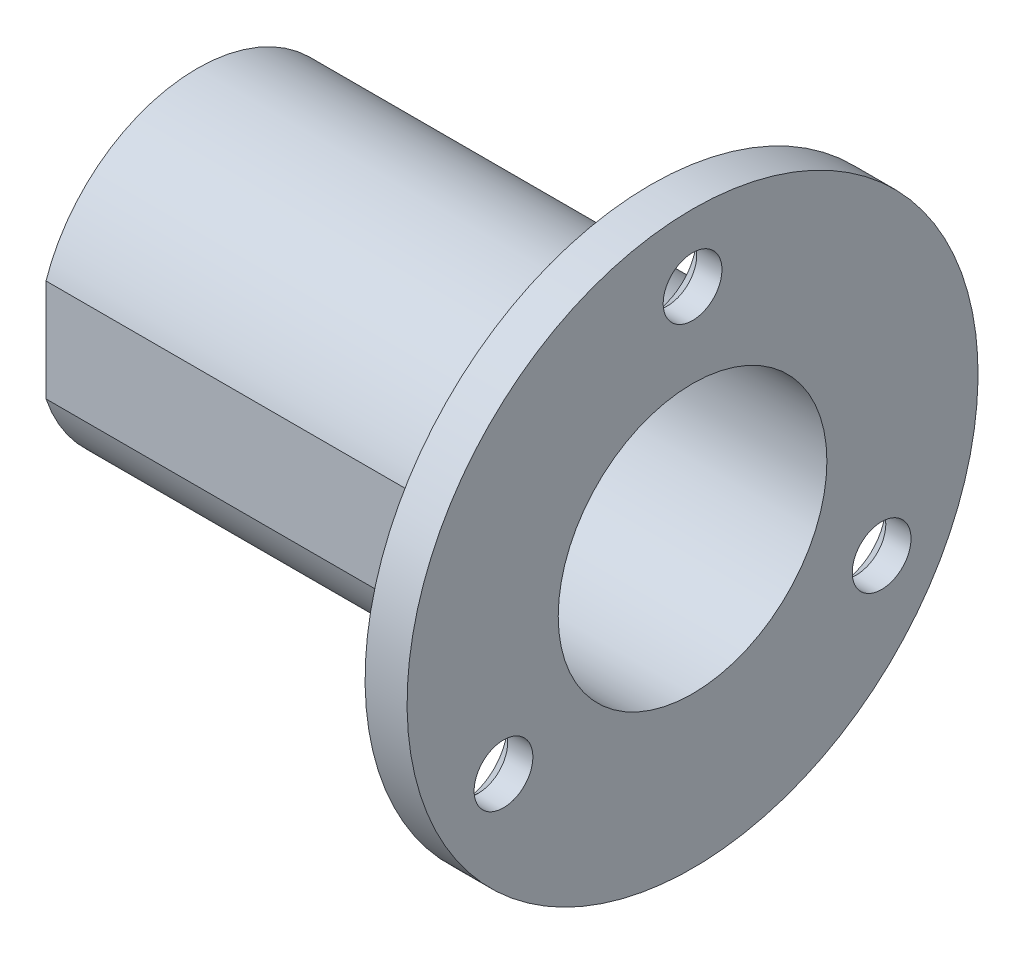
ISO-10303-21;
HEADER;
FILE_DESCRIPTION(('STEP AP214'),'2;1');
FILE_NAME('part.step','',(''),(''),'','','');
FILE_SCHEMA(('AUTOMOTIVE_DESIGN { 1 0 10303 214 1 1 1 1 }'));
ENDSEC;
DATA;
#1=APPLICATION_CONTEXT('core data for automotive mechanical design processes');
#2=APPLICATION_PROTOCOL_DEFINITION('international standard','automotive_design',2000,#1);
#3=PRODUCT_CONTEXT('',#1,'mechanical');
#4=PRODUCT('Part','Part','',(#3));
#5=PRODUCT_RELATED_PRODUCT_CATEGORY('part','',(#4));
#6=PRODUCT_DEFINITION_FORMATION('','',#4);
#7=PRODUCT_DEFINITION_CONTEXT('part definition',#1,'design');
#8=PRODUCT_DEFINITION('design','',#6,#7);
#9=PRODUCT_DEFINITION_SHAPE('','',#8);
#10=(LENGTH_UNIT() NAMED_UNIT(*) SI_UNIT(.MILLI.,.METRE.));
#11=(NAMED_UNIT(*) PLANE_ANGLE_UNIT() SI_UNIT($,.RADIAN.));
#12=(NAMED_UNIT(*) SI_UNIT($,.STERADIAN.) SOLID_ANGLE_UNIT());
#13=UNCERTAINTY_MEASURE_WITH_UNIT(LENGTH_MEASURE(1.E-05),#10,'distance_accuracy_value','');
#14=(GEOMETRIC_REPRESENTATION_CONTEXT(3) GLOBAL_UNCERTAINTY_ASSIGNED_CONTEXT((#13)) GLOBAL_UNIT_ASSIGNED_CONTEXT((#10,
#11,#12)) REPRESENTATION_CONTEXT('',''));
#15=CARTESIAN_POINT('',(0.,0.,0.));
#16=DIRECTION('',(0.,0.,1.));
#17=DIRECTION('',(1.,0.,0.));
#18=AXIS2_PLACEMENT_3D('',#15,#16,#17);
#19=CARTESIAN_POINT('',(11.4164454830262,-22.6498679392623,22.5166604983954));
#20=DIRECTION('',(1.,0.,0.));
#21=DIRECTION('',(0.,0.,-1.));
#22=AXIS2_PLACEMENT_3D('',#19,#20,#21);
#23=CYLINDRICAL_SURFACE('',#22,3.5);
#24=CARTESIAN_POINT('',(11.4164454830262,-22.6498679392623,22.5166604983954));
#25=DIRECTION('',(-1.,0.,0.));
#26=DIRECTION('',(0.,-1.,0.));
#27=AXIS2_PLACEMENT_3D('',#24,#25,#26);
#28=CIRCLE('',#27,3.5);
#29=CARTESIAN_POINT('',(11.4164454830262,-26.1498679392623,22.5166604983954));
#30=VERTEX_POINT('',#29);
#31=EDGE_CURVE('E81',#30,#30,#28,.T.);
#32=ORIENTED_EDGE('',*,*,#31,.T.);
#33=EDGE_LOOP('',(#32));
#34=FACE_BOUND('',#33,.T.);
#35=CARTESIAN_POINT('',(14.4164454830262,-22.6498679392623,22.5166604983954));
#36=DIRECTION('',(1.,0.,0.));
#37=DIRECTION('',(0.,0.,-1.));
#38=AXIS2_PLACEMENT_3D('',#35,#36,#37);
#39=CIRCLE('',#38,3.5);
#40=CARTESIAN_POINT('',(14.4164454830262,-22.6498679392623,19.0166604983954));
#41=VERTEX_POINT('',#40);
#42=EDGE_CURVE('E20',#41,#41,#39,.F.);
#43=ORIENTED_EDGE('',*,*,#42,.F.);
#44=EDGE_LOOP('',(#43));
#45=FACE_BOUND('',#44,.T.);
#46=ADVANCED_FACE('F16',(#34,#45),#23,.F.);
#47=CARTESIAN_POINT('',(11.4164454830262,-22.6498679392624,-22.5166604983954));
#48=DIRECTION('',(1.,0.,0.));
#49=DIRECTION('',(0.,0.,-1.));
#50=AXIS2_PLACEMENT_3D('',#47,#48,#49);
#51=CYLINDRICAL_SURFACE('',#50,3.5);
#52=CARTESIAN_POINT('',(11.4164454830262,-22.6498679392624,-22.5166604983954));
#53=DIRECTION('',(-1.,0.,0.));
#54=DIRECTION('',(0.,-1.,0.));
#55=AXIS2_PLACEMENT_3D('',#52,#53,#54);
#56=CIRCLE('',#55,3.5);
#57=CARTESIAN_POINT('',(11.4164454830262,-26.1498679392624,-22.5166604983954));
#58=VERTEX_POINT('',#57);
#59=EDGE_CURVE('E158',#58,#58,#56,.T.);
#60=ORIENTED_EDGE('',*,*,#59,.T.);
#61=EDGE_LOOP('',(#60));
#62=FACE_BOUND('',#61,.T.);
#63=CARTESIAN_POINT('',(14.4164454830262,-22.6498679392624,-22.5166604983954));
#64=DIRECTION('',(1.,0.,0.));
#65=DIRECTION('',(0.,0.,-1.));
#66=AXIS2_PLACEMENT_3D('',#63,#64,#65);
#67=CIRCLE('',#66,3.5);
#68=CARTESIAN_POINT('',(14.4164454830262,-22.6498679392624,-26.0166604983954));
#69=VERTEX_POINT('',#68);
#70=EDGE_CURVE('E84',#69,#69,#67,.F.);
#71=ORIENTED_EDGE('',*,*,#70,.F.);
#72=EDGE_LOOP('',(#71));
#73=FACE_BOUND('',#72,.T.);
#74=ADVANCED_FACE('F95',(#62,#73),#51,.F.);
#75=CARTESIAN_POINT('',(11.4164454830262,16.3501320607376,0.));
#76=DIRECTION('',(1.,0.,0.));
#77=DIRECTION('',(0.,1.,0.));
#78=AXIS2_PLACEMENT_3D('',#75,#76,#77);
#79=CYLINDRICAL_SURFACE('',#78,3.5);
#80=CARTESIAN_POINT('',(11.4164454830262,16.3501320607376,0.));
#81=DIRECTION('',(-1.,0.,0.));
#82=DIRECTION('',(0.,-1.,0.));
#83=AXIS2_PLACEMENT_3D('',#80,#81,#82);
#84=CIRCLE('',#83,3.5);
#85=CARTESIAN_POINT('',(11.4164454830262,12.8501320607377,0.));
#86=VERTEX_POINT('',#85);
#87=EDGE_CURVE('E48',#86,#86,#84,.T.);
#88=ORIENTED_EDGE('',*,*,#87,.T.);
#89=EDGE_LOOP('',(#88));
#90=FACE_BOUND('',#89,.T.);
#91=CARTESIAN_POINT('',(14.4164454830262,16.3501320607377,0.));
#92=DIRECTION('',(1.,0.,0.));
#93=DIRECTION('',(0.,1.,0.));
#94=AXIS2_PLACEMENT_3D('',#91,#92,#93);
#95=CIRCLE('',#94,3.5);
#96=CARTESIAN_POINT('',(14.4164454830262,19.8501320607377,0.));
#97=VERTEX_POINT('',#96);
#98=EDGE_CURVE('E82',#97,#97,#95,.F.);
#99=ORIENTED_EDGE('',*,*,#98,.F.);
#100=EDGE_LOOP('',(#99));
#101=FACE_BOUND('',#100,.T.);
#102=ADVANCED_FACE('F101',(#90,#101),#79,.F.);
#103=CARTESIAN_POINT('',(14.4164454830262,15.3501320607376,0.));
#104=DIRECTION('',(1.,0.,0.));
#105=DIRECTION('',(0.,0.,-1.));
#106=AXIS2_PLACEMENT_3D('',#103,#104,#105);
#107=PLANE('',#106);
#108=CARTESIAN_POINT('',(14.4164454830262,-9.64986793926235,0.));
#109=DIRECTION('',(1.,0.,0.));
#110=DIRECTION('',(0.,1.,0.));
#111=AXIS2_PLACEMENT_3D('',#108,#109,#110);
#112=CIRCLE('',#111,16.);
#113=CARTESIAN_POINT('',(14.4164454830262,6.35013206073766,0.));
#114=VERTEX_POINT('',#113);
#115=EDGE_CURVE('E47',#114,#114,#112,.F.);
#116=ORIENTED_EDGE('',*,*,#115,.T.);
#117=EDGE_LOOP('',(#116));
#118=FACE_BOUND('',#117,.T.);
#119=ORIENTED_EDGE('',*,*,#98,.T.);
#120=EDGE_LOOP('',(#119));
#121=FACE_BOUND('',#120,.T.);
#122=ORIENTED_EDGE('',*,*,#70,.T.);
#123=EDGE_LOOP('',(#122));
#124=FACE_BOUND('',#123,.T.);
#125=ORIENTED_EDGE('',*,*,#42,.T.);
#126=EDGE_LOOP('',(#125));
#127=FACE_BOUND('',#126,.T.);
#128=CARTESIAN_POINT('',(14.4164454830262,-9.64986793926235,0.));
#129=DIRECTION('',(1.,0.,0.));
#130=DIRECTION('',(0.,1.,0.));
#131=AXIS2_PLACEMENT_3D('',#128,#129,#130);
#132=CIRCLE('',#131,34.);
#133=CARTESIAN_POINT('',(14.4164454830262,24.3501320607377,0.));
#134=VERTEX_POINT('',#133);
#135=EDGE_CURVE('E78',#134,#134,#132,.F.);
#136=ORIENTED_EDGE('',*,*,#135,.F.);
#137=EDGE_LOOP('',(#136));
#138=FACE_BOUND('',#137,.T.);
#139=ADVANCED_FACE('F91',(#118,#121,#124,#127,#138),#107,.T.);
#140=CARTESIAN_POINT('',(11.9164454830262,-9.64986793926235,0.));
#141=DIRECTION('',(1.,0.,0.));
#142=DIRECTION('',(0.,1.,0.));
#143=AXIS2_PLACEMENT_3D('',#140,#141,#142);
#144=CYLINDRICAL_SURFACE('',#143,34.);
#145=ORIENTED_EDGE('',*,*,#135,.T.);
#146=EDGE_LOOP('',(#145));
#147=FACE_BOUND('',#146,.T.);
#148=CARTESIAN_POINT('',(9.41644548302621,-9.64986793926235,0.));
#149=DIRECTION('',(1.,0.,0.));
#150=DIRECTION('',(0.,1.,0.));
#151=AXIS2_PLACEMENT_3D('',#148,#149,#150);
#152=CIRCLE('',#151,34.);
#153=CARTESIAN_POINT('',(9.4164454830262,24.3501320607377,0.));
#154=VERTEX_POINT('',#153);
#155=EDGE_CURVE('E73',#154,#154,#152,.F.);
#156=ORIENTED_EDGE('',*,*,#155,.F.);
#157=EDGE_LOOP('',(#156));
#158=FACE_BOUND('',#157,.T.);
#159=ADVANCED_FACE('F127',(#147,#158),#144,.T.);
#160=CARTESIAN_POINT('',(9.41644548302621,-22.6498679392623,22.5166604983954));
#161=DIRECTION('',(-1.,0.,0.));
#162=DIRECTION('',(0.,0.,1.));
#163=AXIS2_PLACEMENT_3D('',#160,#161,#162);
#164=CONICAL_SURFACE('',#163,5.5,0.785398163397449);
#165=CARTESIAN_POINT('',(9.4164454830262,-22.6498679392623,22.5166604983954));
#166=DIRECTION('',(-1.,0.,0.));
#167=DIRECTION('',(0.,0.,1.));
#168=AXIS2_PLACEMENT_3D('',#165,#166,#167);
#169=CIRCLE('',#168,5.50000000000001);
#170=CARTESIAN_POINT('',(9.4164454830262,-22.6498679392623,28.0166604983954));
#171=VERTEX_POINT('',#170);
#172=EDGE_CURVE('E70',#171,#171,#169,.F.);
#173=ORIENTED_EDGE('',*,*,#172,.F.);
#174=EDGE_LOOP('',(#173));
#175=FACE_BOUND('',#174,.T.);
#176=ORIENTED_EDGE('',*,*,#31,.F.);
#177=EDGE_LOOP('',(#176));
#178=FACE_BOUND('',#177,.T.);
#179=ADVANCED_FACE('F130',(#175,#178),#164,.F.);
#180=CARTESIAN_POINT('',(9.41644548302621,-22.6498679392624,-22.5166604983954));
#181=DIRECTION('',(-1.,0.,0.));
#182=DIRECTION('',(0.,-1.,0.));
#183=AXIS2_PLACEMENT_3D('',#180,#181,#182);
#184=CONICAL_SURFACE('',#183,5.50000000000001,0.785398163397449);
#185=CARTESIAN_POINT('',(9.41644548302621,-22.6498679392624,-22.5166604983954));
#186=DIRECTION('',(-1.,0.,0.));
#187=DIRECTION('',(0.,-1.,0.));
#188=AXIS2_PLACEMENT_3D('',#185,#186,#187);
#189=CIRCLE('',#188,5.50000000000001);
#190=CARTESIAN_POINT('',(9.41644548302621,-28.1498679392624,-22.5166604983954));
#191=VERTEX_POINT('',#190);
#192=EDGE_CURVE('E67',#191,#191,#189,.F.);
#193=ORIENTED_EDGE('',*,*,#192,.F.);
#194=EDGE_LOOP('',(#193));
#195=FACE_BOUND('',#194,.T.);
#196=ORIENTED_EDGE('',*,*,#59,.F.);
#197=EDGE_LOOP('',(#196));
#198=FACE_BOUND('',#197,.T.);
#199=ADVANCED_FACE('F147',(#195,#198),#184,.F.);
#200=CARTESIAN_POINT('',(9.41644548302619,16.3501320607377,0.));
#201=DIRECTION('',(-1.,0.,0.));
#202=DIRECTION('',(0.,-1.,0.));
#203=AXIS2_PLACEMENT_3D('',#200,#201,#202);
#204=CONICAL_SURFACE('',#203,5.5,0.785398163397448);
#205=CARTESIAN_POINT('',(9.4164454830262,16.3501320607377,0.));
#206=DIRECTION('',(-1.,0.,0.));
#207=DIRECTION('',(0.,-1.,0.));
#208=AXIS2_PLACEMENT_3D('',#205,#206,#207);
#209=CIRCLE('',#208,5.5);
#210=CARTESIAN_POINT('',(9.4164454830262,10.8501320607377,0.));
#211=VERTEX_POINT('',#210);
#212=EDGE_CURVE('E59',#211,#211,#209,.F.);
#213=ORIENTED_EDGE('',*,*,#212,.F.);
#214=EDGE_LOOP('',(#213));
#215=FACE_BOUND('',#214,.T.);
#216=ORIENTED_EDGE('',*,*,#87,.F.);
#217=EDGE_LOOP('',(#216));
#218=FACE_BOUND('',#217,.T.);
#219=ADVANCED_FACE('F18',(#215,#218),#204,.F.);
#220=CARTESIAN_POINT('',(-0.583554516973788,-31.7639238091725,19.));
#221=DIRECTION('',(1.,0.,0.));
#222=DIRECTION('',(0.,0.,-1.));
#223=AXIS2_PLACEMENT_3D('',#220,#221,#222);
#224=PLANE('',#223);
#225=DIRECTION('',(0.,1.,0.));
#226=VECTOR('',#225,1.);
#227=CARTESIAN_POINT('',(-0.583554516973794,-10.0795749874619,18.));
#228=LINE('',#227,#226);
#229=CARTESIAN_POINT('',(-0.583554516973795,-15.7326304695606,18.));
#230=VERTEX_POINT('',#229);
#231=CARTESIAN_POINT('',(-0.583554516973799,-3.56710540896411,18.));
#232=VERTEX_POINT('',#231);
#233=EDGE_CURVE('E41',#230,#232,#228,.T.);
#234=ORIENTED_EDGE('',*,*,#233,.F.);
#235=CARTESIAN_POINT('',(-0.583554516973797,-9.64986793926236,0.));
#236=DIRECTION('',(1.,0.,0.));
#237=DIRECTION('',(0.,1.,0.));
#238=AXIS2_PLACEMENT_3D('',#235,#236,#237);
#239=CIRCLE('',#238,19.);
#240=EDGE_CURVE('E46',#232,#230,#239,.T.);
#241=ORIENTED_EDGE('',*,*,#240,.F.);
#242=EDGE_LOOP('',(#234,#241));
#243=FACE_BOUND('',#242,.T.);
#244=ADVANCED_FACE('F44',(#243),#224,.F.);
#245=CARTESIAN_POINT('',(-23.4350129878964,-10.0795749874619,18.));
#246=DIRECTION('',(0.,0.,1.));
#247=DIRECTION('',(1.,0.,0.));
#248=AXIS2_PLACEMENT_3D('',#245,#246,#247);
#249=PLANE('',#248);
#250=DIRECTION('',(1.,0.,0.));
#251=VECTOR('',#250,1.);
#252=CARTESIAN_POINT('',(-17.5835545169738,-15.7326304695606,18.));
#253=LINE('',#252,#251);
#254=CARTESIAN_POINT('',(-44.5835545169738,-15.7326304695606,18.));
#255=VERTEX_POINT('',#254);
#256=EDGE_CURVE('E51',#230,#255,#253,.F.);
#257=ORIENTED_EDGE('',*,*,#256,.F.);
#258=ORIENTED_EDGE('',*,*,#233,.T.);
#259=DIRECTION('',(1.,0.,0.));
#260=VECTOR('',#259,1.);
#261=CARTESIAN_POINT('',(-17.5835545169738,-3.56710540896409,18.));
#262=LINE('',#261,#260);
#263=CARTESIAN_POINT('',(-44.5835545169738,-3.56710540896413,18.));
#264=VERTEX_POINT('',#263);
#265=EDGE_CURVE('E57',#264,#232,#262,.T.);
#266=ORIENTED_EDGE('',*,*,#265,.F.);
#267=DIRECTION('',(0.,1.,0.));
#268=VECTOR('',#267,1.);
#269=CARTESIAN_POINT('',(-44.5835545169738,7.85013206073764,18.));
#270=LINE('',#269,#268);
#271=EDGE_CURVE('E54',#255,#264,#270,.T.);
#272=ORIENTED_EDGE('',*,*,#271,.F.);
#273=EDGE_LOOP('',(#257,#258,#266,#272));
#274=FACE_BOUND('',#273,.T.);
#275=ADVANCED_FACE('F52',(#274),#249,.T.);
#276=CARTESIAN_POINT('',(-15.0835545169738,-9.64986793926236,0.));
#277=DIRECTION('',(1.,0.,0.));
#278=DIRECTION('',(0.,1.,0.));
#279=AXIS2_PLACEMENT_3D('',#276,#277,#278);
#280=CYLINDRICAL_SURFACE('',#279,16.);
#281=CARTESIAN_POINT('',(-44.5835545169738,-9.64986793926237,0.));
#282=DIRECTION('',(1.,0.,0.));
#283=DIRECTION('',(0.,1.,0.));
#284=AXIS2_PLACEMENT_3D('',#281,#282,#283);
#285=CIRCLE('',#284,16.);
#286=CARTESIAN_POINT('',(-44.5835545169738,6.35013206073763,0.));
#287=VERTEX_POINT('',#286);
#288=EDGE_CURVE('E63',#287,#287,#285,.T.);
#289=ORIENTED_EDGE('',*,*,#288,.F.);
#290=EDGE_LOOP('',(#289));
#291=FACE_BOUND('',#290,.T.);
#292=ORIENTED_EDGE('',*,*,#115,.F.);
#293=EDGE_LOOP('',(#292));
#294=FACE_BOUND('',#293,.T.);
#295=ADVANCED_FACE('F118',(#291,#294),#280,.F.);
#296=CARTESIAN_POINT('',(9.4164454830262,16.8501320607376,0.));
#297=DIRECTION('',(-1.,0.,0.));
#298=DIRECTION('',(0.,0.,1.));
#299=AXIS2_PLACEMENT_3D('',#296,#297,#298);
#300=PLANE('',#299);
#301=CARTESIAN_POINT('',(9.41644548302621,-9.64986793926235,0.));
#302=DIRECTION('',(1.,0.,0.));
#303=DIRECTION('',(0.,1.,0.));
#304=AXIS2_PLACEMENT_3D('',#301,#302,#303);
#305=CIRCLE('',#304,19.);
#306=CARTESIAN_POINT('',(9.4164454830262,9.35013206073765,0.));
#307=VERTEX_POINT('',#306);
#308=EDGE_CURVE('E26',#307,#307,#305,.F.);
#309=ORIENTED_EDGE('',*,*,#308,.F.);
#310=EDGE_LOOP('',(#309));
#311=FACE_BOUND('',#310,.T.);
#312=ORIENTED_EDGE('',*,*,#212,.T.);
#313=EDGE_LOOP('',(#312));
#314=FACE_BOUND('',#313,.T.);
#315=ORIENTED_EDGE('',*,*,#192,.T.);
#316=EDGE_LOOP('',(#315));
#317=FACE_BOUND('',#316,.T.);
#318=ORIENTED_EDGE('',*,*,#172,.T.);
#319=EDGE_LOOP('',(#318));
#320=FACE_BOUND('',#319,.T.);
#321=ORIENTED_EDGE('',*,*,#155,.T.);
#322=EDGE_LOOP('',(#321));
#323=FACE_BOUND('',#322,.T.);
#324=ADVANCED_FACE('F111',(#311,#314,#317,#320,#323),#300,.T.);
#325=CARTESIAN_POINT('',(-44.5835545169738,7.85013206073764,0.));
#326=DIRECTION('',(-1.,0.,0.));
#327=DIRECTION('',(0.,0.,1.));
#328=AXIS2_PLACEMENT_3D('',#325,#326,#327);
#329=PLANE('',#328);
#330=ORIENTED_EDGE('',*,*,#288,.T.);
#331=EDGE_LOOP('',(#330));
#332=FACE_BOUND('',#331,.T.);
#333=CARTESIAN_POINT('',(-44.5835545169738,-9.64986793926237,0.));
#334=DIRECTION('',(1.,0.,0.));
#335=DIRECTION('',(0.,1.,0.));
#336=AXIS2_PLACEMENT_3D('',#333,#334,#335);
#337=CIRCLE('',#336,19.);
#338=EDGE_CURVE('E10',#255,#264,#337,.T.);
#339=ORIENTED_EDGE('',*,*,#338,.F.);
#340=ORIENTED_EDGE('',*,*,#271,.T.);
#341=EDGE_LOOP('',(#339,#340));
#342=FACE_BOUND('',#341,.T.);
#343=ADVANCED_FACE('F107',(#332,#342),#329,.T.);
#344=CARTESIAN_POINT('',(-17.5835545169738,-9.64986793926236,0.));
#345=DIRECTION('',(1.,0.,0.));
#346=DIRECTION('',(0.,1.,0.));
#347=AXIS2_PLACEMENT_3D('',#344,#345,#346);
#348=CYLINDRICAL_SURFACE('',#347,19.);
#349=ORIENTED_EDGE('',*,*,#308,.T.);
#350=EDGE_LOOP('',(#349));
#351=FACE_BOUND('',#350,.T.);
#352=ORIENTED_EDGE('',*,*,#338,.T.);
#353=ORIENTED_EDGE('',*,*,#265,.T.);
#354=ORIENTED_EDGE('',*,*,#240,.T.);
#355=ORIENTED_EDGE('',*,*,#256,.T.);
#356=EDGE_LOOP('',(#352,#353,#354,#355));
#357=FACE_BOUND('',#356,.T.);
#358=ADVANCED_FACE('F56',(#351,#357),#348,.T.);
#359=CLOSED_SHELL('',(#46,#74,#102,#139,#159,#179,#199,#219,#244,#275,#295,#324,#343,#358));
#360=MANIFOLD_SOLID_BREP('B1',#359);
#361=ADVANCED_BREP_SHAPE_REPRESENTATION('',(#18,#360),#14);
#362=SHAPE_DEFINITION_REPRESENTATION(#9,#361);
ENDSEC;
END-ISO-10303-21;
